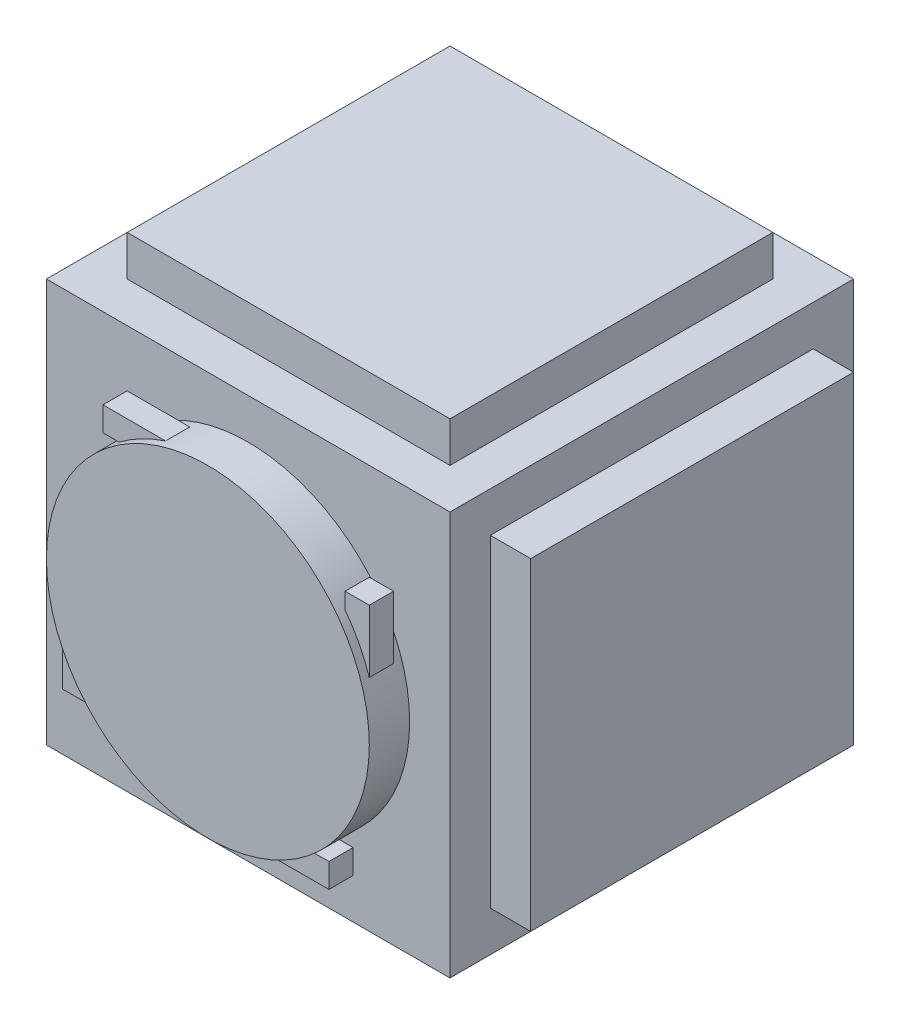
from build123d import *

# Parameters (mm, degrees)
SKETCH1_W           = 250
SKETCH1_H           = 250
BOSS_EXTRUDE1_DEPTH = 250
SKETCH2_W           = 200
SKETCH2_H           = 200
BOSS_EXTRUDE2_DEPTH = 25
CIRPATTERN1_COUNT   = 4
SKETCH5_W           = 100
SKETCH5_H           = 25
SKETCH6_W           = 15
SKETCH6_H           = 15
BOSS_EXTRUDE4_DEPTH = 70
CIRPATTERN2_COUNT   = 4
SCALE1_SCALE        = 0.5


with BuildPart() as part:
    # Sketch1 → Boss-Extrude1 (new body)
    with BuildSketch(Plane.XY):
        with Locations((125, 125)):
            Rectangle(SKETCH1_W, SKETCH1_H)
    extrude(amount=BOSS_EXTRUDE1_DEPTH)

    # Sketch2 → Boss-Extrude2 (add)
    with BuildSketch(Plane(origin=(0, 250, 0), x_dir=(1, 0, 0), z_dir=(0, 1, 0))):
        with Locations((125, -125)):
            Rectangle(SKETCH2_W, SKETCH2_H)
    boss_extrude2 = extrude(amount=BOSS_EXTRUDE2_DEPTH)

    # CirPattern1: Boss-Extrude2 ×4 about axis
    cirpattern1_axis = Axis((125, 125, 0), (0, 0, 1))
    for i in range(1, CIRPATTERN1_COUNT):
        add(boss_extrude2.rotate(cirpattern1_axis, i * 360 / CIRPATTERN1_COUNT))

    # Sketch5 → Revolve1 (revolve)
    with BuildSketch(Plane(origin=(0, 125, 0), x_dir=(1, 0, 0), z_dir=(0, 1, 0)), mode=Mode.PRIVATE) as revolve1_sk:
        with Locations((175, -262.5)):
            Rectangle(SKETCH5_W, SKETCH5_H)
    revolve(revolve1_sk.sketch.rotate(Axis((125, 125, 250), (0, 0, 1)), 180), axis=Axis((125, 125, 250), (0, 0, 1)))

    # Sketch6 → Boss-Extrude4 (add)
    with BuildSketch(Plane(origin=(0, 125, 0), x_dir=(1, 0, 0), z_dir=(0, 1, 0))):
        with Locations((212.5, -262.5)):
            Rectangle(SKETCH6_W, SKETCH6_H)
    boss_extrude4 = extrude(amount=BOSS_EXTRUDE4_DEPTH)

    # CirPattern2: Boss-Extrude4 ×4 about axis
    cirpattern2_axis = Axis((125, 125, 0), (0, 0, 1))
    for i in range(1, CIRPATTERN2_COUNT):
        add(boss_extrude4.rotate(cirpattern2_axis, i * 360 / CIRPATTERN2_COUNT))


with BuildPart() as part_1:
    # Scale1: scaled about (125, 125, 130.421929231)
    add(part.part.scale(SCALE1_SCALE).moved(Location((62.5, 62.5, 65.210964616))))


solid = part_1.part
